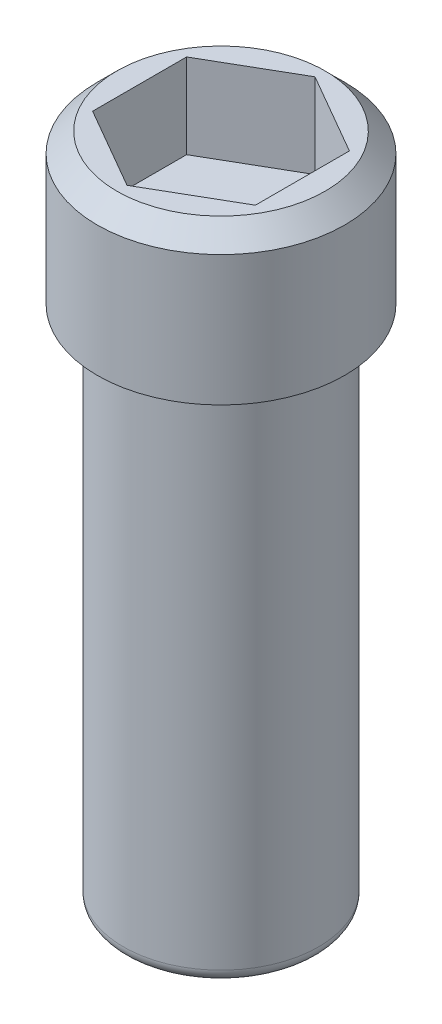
from build123d import *

# Parameters (mm, degrees)
CONG_1_R                = 0.2
ENL_V_MAT_EXTRU_1_DEPTH = 1.3
CHANFREIN1_SIZE         = 0.3


with BuildPart() as part:
    # Esquisse1 → R_volution1 (revolve)
    with BuildSketch(Plane.XY, mode=Mode.PRIVATE) as r_volution1_sk:
        Polygon((0, 0), (1.5, 0), (1.5, 8), (1.9, 8), (1.9, 10.3), (0, 10.3), align=None)
    revolve(r_volution1_sk.sketch.rotate(Axis((0, 0, 0), (0, 1, 0)), 90), axis=Axis((0, 0, 0), (0, 1, 0)))

    # Cong_1
    cong_1_edges = [part.edges().sort_by_distance(p)[0] for p in [
        (0, 0, 1.5),
    ]]
    fillet(cong_1_edges, radius=CONG_1_R)

    # Esquisse2 → Enl_v. mat.-Extru.1 (cut)
    with BuildSketch(Plane(origin=(0, 10.3, 0), x_dir=(-1, 0, 0), z_dir=(0, 1, 0))):
        Polygon((1.25, -0.721687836), (1.25, 0.721687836), (0, 1.443375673), (-1.25, 0.721687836), (-1.25, -0.721687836), (0, -1.443375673), align=None)
    extrude(amount=-ENL_V_MAT_EXTRU_1_DEPTH, mode=Mode.SUBTRACT)

    # Chanfrein1
    chanfrein1_edges = [part.edges().sort_by_distance(p)[0] for p in [
        (0, 10.3, 1.9),
    ]]
    chamfer(chanfrein1_edges, length=CHANFREIN1_SIZE)


solid = part.part
